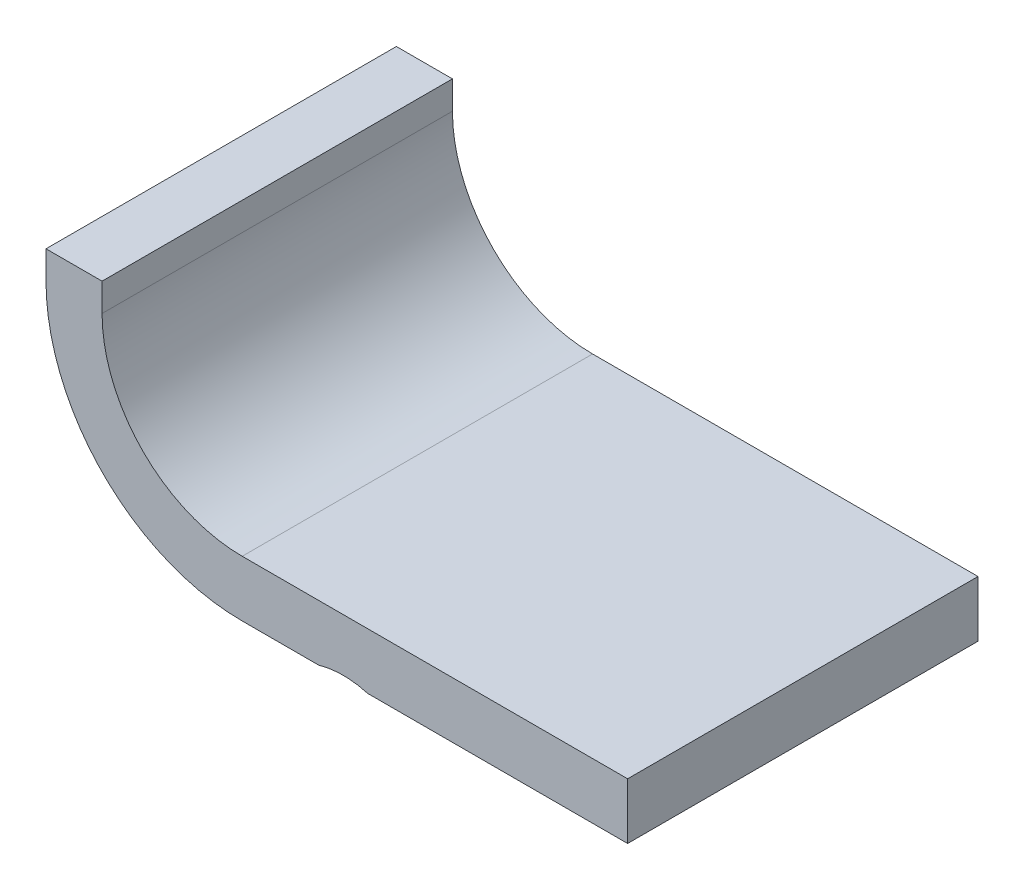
from build123d import *

# Parameters (mm, degrees)
EXTRUSION1_DEPTH        = 50
ESQUISSE2_R             = 12.5
ENL_V_MAT_EXTRU_1_DEPTH = 103.04410811


with BuildPart() as part:
    # Esquisse1 → Extrusion1 (new body)
    with BuildSketch(Plane.XY):
        with BuildLine():
            Line((0, 0), (-55, 0))
            ThreePointArc((-55, 0), (-74.798989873, 8.201010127), (-83, 28))
            Line((-83, 28), (-83, 32))
            Line((-83, 32), (-75, 32))
            Line((-75, 32), (-75, 28))
            ThreePointArc((-75, 28), (-69.142135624, 13.857864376), (-55, 8))
            Line((-55, 8), (0, 8))
            Line((0, 8), (0, 0))
        make_face()
    extrude(amount=EXTRUSION1_DEPTH)

    # Esquisse2 → Enl_v. mat.-Extru.1 (cut, through all)
    with BuildSketch(Plane(origin=(0, 0, 0), x_dir=(-1, 0, 0), z_dir=(0, 0, -1))):
        with Locations((40.6, -12)):
            Circle(ESQUISSE2_R)
    extrude(amount=-ENL_V_MAT_EXTRU_1_DEPTH, mode=Mode.SUBTRACT)


solid = part.part
